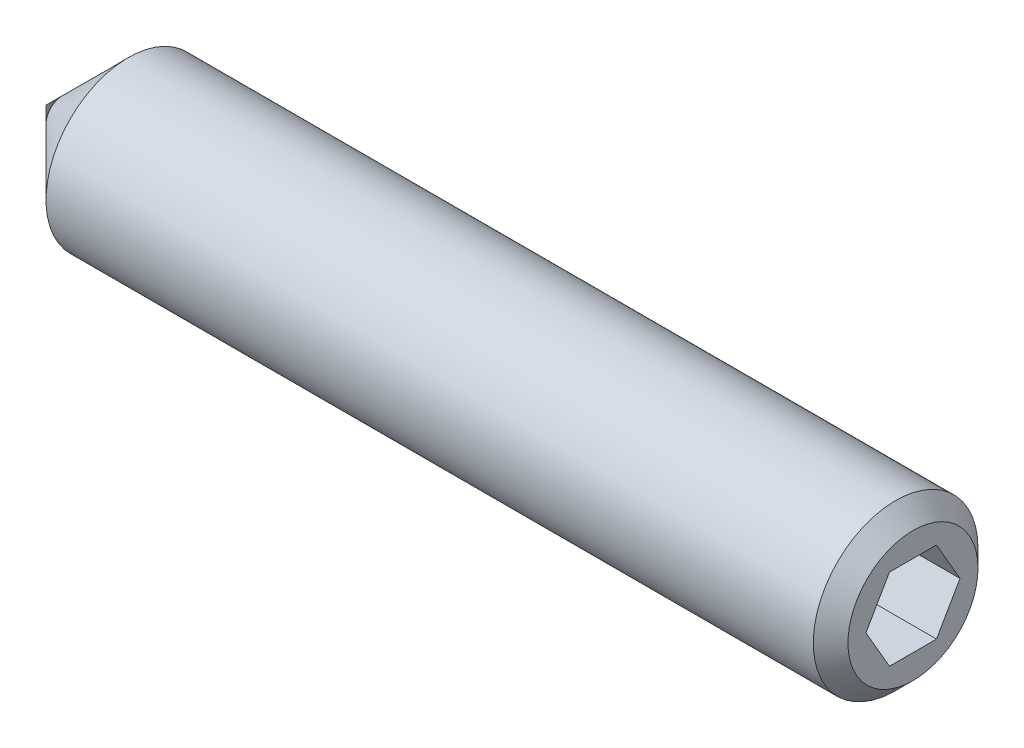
ISO-10303-21;
HEADER;
FILE_DESCRIPTION(('STEP AP214'),'2;1');
FILE_NAME('part.step','',(''),(''),'','','');
FILE_SCHEMA(('AUTOMOTIVE_DESIGN { 1 0 10303 214 1 1 1 1 }'));
ENDSEC;
DATA;
#1=APPLICATION_CONTEXT('core data for automotive mechanical design processes');
#2=APPLICATION_PROTOCOL_DEFINITION('international standard','automotive_design',2000,#1);
#3=PRODUCT_CONTEXT('',#1,'mechanical');
#4=PRODUCT('Part','Part','',(#3));
#5=PRODUCT_RELATED_PRODUCT_CATEGORY('part','',(#4));
#6=PRODUCT_DEFINITION_FORMATION('','',#4);
#7=PRODUCT_DEFINITION_CONTEXT('part definition',#1,'design');
#8=PRODUCT_DEFINITION('design','',#6,#7);
#9=PRODUCT_DEFINITION_SHAPE('','',#8);
#10=(LENGTH_UNIT() NAMED_UNIT(*) SI_UNIT(.MILLI.,.METRE.));
#11=(NAMED_UNIT(*) PLANE_ANGLE_UNIT() SI_UNIT($,.RADIAN.));
#12=(NAMED_UNIT(*) SI_UNIT($,.STERADIAN.) SOLID_ANGLE_UNIT());
#13=UNCERTAINTY_MEASURE_WITH_UNIT(LENGTH_MEASURE(1.E-05),#10,'distance_accuracy_value','');
#14=(GEOMETRIC_REPRESENTATION_CONTEXT(3) GLOBAL_UNCERTAINTY_ASSIGNED_CONTEXT((#13)) GLOBAL_UNIT_ASSIGNED_CONTEXT((#10,
#11,#12)) REPRESENTATION_CONTEXT('',''));
#15=CARTESIAN_POINT('',(0.,0.,0.));
#16=DIRECTION('',(0.,0.,1.));
#17=DIRECTION('',(1.,0.,0.));
#18=AXIS2_PLACEMENT_3D('',#15,#16,#17);
#19=CARTESIAN_POINT('',(25.4000000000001,2.41300000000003,0.));
#20=DIRECTION('',(1.,0.,0.));
#21=DIRECTION('',(0.,0.,-1.));
#22=AXIS2_PLACEMENT_3D('',#19,#20,#21);
#23=PLANE('',#22);
#24=DIRECTION('',(0.,-0.866025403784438,0.500000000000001));
#25=VECTOR('',#24,1.);
#26=CARTESIAN_POINT('',(25.3999999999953,0.,1.37848150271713));
#27=LINE('',#26,#25);
#28=CARTESIAN_POINT('',(25.3999999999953,1.19379999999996,0.6892407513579));
#29=VERTEX_POINT('',#28);
#30=CARTESIAN_POINT('',(25.4,0.,1.37848150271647));
#31=VERTEX_POINT('',#30);
#32=EDGE_CURVE('E44',#29,#31,#27,.T.);
#33=ORIENTED_EDGE('',*,*,#32,.F.);
#34=DIRECTION('',(0.,0.,1.));
#35=VECTOR('',#34,1.);
#36=CARTESIAN_POINT('',(25.3999999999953,1.19379999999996,0.6892407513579));
#37=LINE('',#36,#35);
#38=CARTESIAN_POINT('',(25.3999999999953,1.19379999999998,-0.689240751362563));
#39=VERTEX_POINT('',#38);
#40=EDGE_CURVE('E112',#39,#29,#37,.T.);
#41=ORIENTED_EDGE('',*,*,#40,.F.);
#42=DIRECTION('',(0.,0.866025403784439,0.499999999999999));
#43=VECTOR('',#42,1.);
#44=CARTESIAN_POINT('',(25.3999999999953,1.19379999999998,-0.689240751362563));
#45=LINE('',#44,#43);
#46=CARTESIAN_POINT('',(25.3999999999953,0.,-1.37848150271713));
#47=VERTEX_POINT('',#46);
#48=EDGE_CURVE('E106',#47,#39,#45,.T.);
#49=ORIENTED_EDGE('',*,*,#48,.F.);
#50=DIRECTION('',(0.,0.866025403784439,-0.5));
#51=VECTOR('',#50,1.);
#52=CARTESIAN_POINT('',(25.3999999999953,0.,-1.37848150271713));
#53=LINE('',#52,#51);
#54=CARTESIAN_POINT('',(25.3999999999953,-1.19379999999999,-0.689240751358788));
#55=VERTEX_POINT('',#54);
#56=EDGE_CURVE('E104',#55,#47,#53,.T.);
#57=ORIENTED_EDGE('',*,*,#56,.F.);
#58=DIRECTION('',(0.,0.,-1.));
#59=VECTOR('',#58,1.);
#60=CARTESIAN_POINT('',(25.3999999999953,-1.19379999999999,-0.689240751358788));
#61=LINE('',#60,#59);
#62=CARTESIAN_POINT('',(25.3999999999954,-1.19379999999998,0.689240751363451));
#63=VERTEX_POINT('',#62);
#64=EDGE_CURVE('E86',#63,#55,#61,.T.);
#65=ORIENTED_EDGE('',*,*,#64,.F.);
#66=DIRECTION('',(0.,-0.86602540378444,-0.500000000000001));
#67=VECTOR('',#66,1.);
#68=CARTESIAN_POINT('',(25.3999999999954,-1.19379999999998,0.689240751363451));
#69=LINE('',#68,#67);
#70=EDGE_CURVE('E97',#31,#63,#69,.T.);
#71=ORIENTED_EDGE('',*,*,#70,.F.);
#72=EDGE_LOOP('',(#33,#41,#49,#57,#65,#71));
#73=FACE_BOUND('',#72,.T.);
#74=CARTESIAN_POINT('',(25.4,0.,-3.99680288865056E-12));
#75=DIRECTION('',(1.,0.,0.));
#76=DIRECTION('',(0.,0.,-1.));
#77=AXIS2_PLACEMENT_3D('',#74,#75,#76);
#78=CIRCLE('',#77,1.90499999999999);
#79=CARTESIAN_POINT('',(25.4,0.,-1.90500000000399));
#80=VERTEX_POINT('',#79);
#81=EDGE_CURVE('E37',#80,#80,#78,.T.);
#82=ORIENTED_EDGE('',*,*,#81,.T.);
#83=EDGE_LOOP('',(#82));
#84=FACE_BOUND('',#83,.T.);
#85=ADVANCED_FACE('F30',(#73,#84),#23,.T.);
#86=CARTESIAN_POINT('',(0.,0.,0.));
#87=DIRECTION('',(1.,0.,0.));
#88=DIRECTION('',(0.,0.,-1.));
#89=AXIS2_PLACEMENT_3D('',#86,#87,#88);
#90=CYLINDRICAL_SURFACE('',#89,2.413);
#91=CARTESIAN_POINT('',(24.8920000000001,0.,0.));
#92=DIRECTION('',(1.,0.,0.));
#93=DIRECTION('',(0.,0.,-1.));
#94=AXIS2_PLACEMENT_3D('',#91,#92,#93);
#95=CIRCLE('',#94,2.413);
#96=CARTESIAN_POINT('',(24.8920000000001,0.,-2.413));
#97=VERTEX_POINT('',#96);
#98=EDGE_CURVE('E11',#97,#97,#95,.F.);
#99=ORIENTED_EDGE('',*,*,#98,.T.);
#100=EDGE_LOOP('',(#99));
#101=FACE_BOUND('',#100,.T.);
#102=CARTESIAN_POINT('',(2.41300000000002,0.,-8.88178419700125E-13));
#103=DIRECTION('',(1.,0.,0.));
#104=DIRECTION('',(0.,0.,-1.));
#105=AXIS2_PLACEMENT_3D('',#102,#103,#104);
#106=CIRCLE('',#105,2.413);
#107=CARTESIAN_POINT('',(2.41300000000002,0.,-2.41300000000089));
#108=VERTEX_POINT('',#107);
#109=EDGE_CURVE('E132',#108,#108,#106,.T.);
#110=ORIENTED_EDGE('',*,*,#109,.T.);
#111=EDGE_LOOP('',(#110));
#112=FACE_BOUND('',#111,.T.);
#113=ADVANCED_FACE('F155',(#101,#112),#90,.T.);
#114=CARTESIAN_POINT('',(2.41300000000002,0.,-8.88178419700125E-13));
#115=DIRECTION('',(1.,0.,0.));
#116=DIRECTION('',(0.,0.,-1.));
#117=AXIS2_PLACEMENT_3D('',#114,#115,#116);
#118=CONICAL_SURFACE('',#117,2.413,0.785398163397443);
#119=CARTESIAN_POINT('',(0.,0.,0.));
#120=VERTEX_POINT('',#119);
#121=VERTEX_LOOP('',#120);
#122=FACE_BOUND('',#121,.T.);
#123=ORIENTED_EDGE('',*,*,#109,.F.);
#124=EDGE_LOOP('',(#123));
#125=FACE_BOUND('',#124,.T.);
#126=ADVANCED_FACE('F146',(#122,#125),#118,.T.);
#127=CARTESIAN_POINT('',(25.4,0.,-3.99680288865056E-12));
#128=DIRECTION('',(-1.,0.,0.));
#129=DIRECTION('',(0.,0.,1.));
#130=AXIS2_PLACEMENT_3D('',#127,#128,#129);
#131=CONICAL_SURFACE('',#130,1.90499999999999,0.785398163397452);
#132=ORIENTED_EDGE('',*,*,#98,.F.);
#133=EDGE_LOOP('',(#132));
#134=FACE_BOUND('',#133,.T.);
#135=ORIENTED_EDGE('',*,*,#81,.F.);
#136=EDGE_LOOP('',(#135));
#137=FACE_BOUND('',#136,.T.);
#138=ADVANCED_FACE('F143',(#134,#137),#131,.T.);
#139=CARTESIAN_POINT('',(22.3519999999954,0.,1.37848150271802));
#140=DIRECTION('',(0.,0.500000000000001,0.86602540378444));
#141=DIRECTION('',(0.,-0.866025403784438,0.500000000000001));
#142=AXIS2_PLACEMENT_3D('',#139,#140,#141);
#143=PLANE('',#142);
#144=ORIENTED_EDGE('',*,*,#32,.T.);
#145=DIRECTION('',(1.,0.,0.));
#146=VECTOR('',#145,1.);
#147=CARTESIAN_POINT('',(22.3519999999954,0.,1.37848150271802));
#148=LINE('',#147,#146);
#149=CARTESIAN_POINT('',(22.3519999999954,0.,1.37848150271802));
#150=VERTEX_POINT('',#149);
#151=EDGE_CURVE('E94',#150,#31,#148,.T.);
#152=ORIENTED_EDGE('',*,*,#151,.F.);
#153=DIRECTION('',(0.,-0.866025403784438,0.500000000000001));
#154=VECTOR('',#153,1.);
#155=CARTESIAN_POINT('',(22.3519999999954,0.,1.37848150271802));
#156=LINE('',#155,#154);
#157=CARTESIAN_POINT('',(22.3519999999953,1.19380000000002,0.689240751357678));
#158=VERTEX_POINT('',#157);
#159=EDGE_CURVE('E115',#158,#150,#156,.T.);
#160=ORIENTED_EDGE('',*,*,#159,.F.);
#161=DIRECTION('',(1.,0.,0.));
#162=VECTOR('',#161,1.);
#163=CARTESIAN_POINT('',(22.3519999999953,1.19380000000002,0.689240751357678));
#164=LINE('',#163,#162);
#165=EDGE_CURVE('E130',#158,#29,#164,.T.);
#166=ORIENTED_EDGE('',*,*,#165,.T.);
#167=EDGE_LOOP('',(#144,#152,#160,#166));
#168=FACE_BOUND('',#167,.T.);
#169=ADVANCED_FACE('F145',(#168),#143,.F.);
#170=CARTESIAN_POINT('',(22.3519999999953,1.19380000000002,0.689240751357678));
#171=DIRECTION('',(0.,0.999999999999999,0.));
#172=DIRECTION('',(0.,0.,1.));
#173=AXIS2_PLACEMENT_3D('',#170,#171,#172);
#174=PLANE('',#173);
#175=ORIENTED_EDGE('',*,*,#40,.T.);
#176=ORIENTED_EDGE('',*,*,#165,.F.);
#177=DIRECTION('',(0.,0.,1.));
#178=VECTOR('',#177,1.);
#179=CARTESIAN_POINT('',(22.3519999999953,1.19380000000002,0.689240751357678));
#180=LINE('',#179,#178);
#181=CARTESIAN_POINT('',(22.3519999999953,1.1938,-0.689240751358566));
#182=VERTEX_POINT('',#181);
#183=EDGE_CURVE('E127',#182,#158,#180,.T.);
#184=ORIENTED_EDGE('',*,*,#183,.F.);
#185=DIRECTION('',(1.,0.,0.));
#186=VECTOR('',#185,1.);
#187=CARTESIAN_POINT('',(22.3519999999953,1.1938,-0.689240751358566));
#188=LINE('',#187,#186);
#189=EDGE_CURVE('E133',#182,#39,#188,.T.);
#190=ORIENTED_EDGE('',*,*,#189,.T.);
#191=EDGE_LOOP('',(#175,#176,#184,#190));
#192=FACE_BOUND('',#191,.T.);
#193=ADVANCED_FACE('F153',(#192),#174,.F.);
#194=CARTESIAN_POINT('',(22.3519999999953,1.1938,-0.689240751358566));
#195=DIRECTION('',(0.,0.499999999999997,-0.866025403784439));
#196=DIRECTION('',(0.,0.866025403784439,0.499999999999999));
#197=AXIS2_PLACEMENT_3D('',#194,#195,#196);
#198=PLANE('',#197);
#199=ORIENTED_EDGE('',*,*,#48,.T.);
#200=ORIENTED_EDGE('',*,*,#189,.F.);
#201=DIRECTION('',(0.,0.866025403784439,0.499999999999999));
#202=VECTOR('',#201,1.);
#203=CARTESIAN_POINT('',(22.3519999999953,1.1938,-0.689240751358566));
#204=LINE('',#203,#202);
#205=CARTESIAN_POINT('',(22.3519999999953,0.,-1.37848150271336));
#206=VERTEX_POINT('',#205);
#207=EDGE_CURVE('E124',#206,#182,#204,.T.);
#208=ORIENTED_EDGE('',*,*,#207,.F.);
#209=DIRECTION('',(1.,0.,0.));
#210=VECTOR('',#209,1.);
#211=CARTESIAN_POINT('',(22.3519999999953,0.,-1.37848150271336));
#212=LINE('',#211,#210);
#213=EDGE_CURVE('E135',#206,#47,#212,.T.);
#214=ORIENTED_EDGE('',*,*,#213,.T.);
#215=EDGE_LOOP('',(#199,#200,#208,#214));
#216=FACE_BOUND('',#215,.T.);
#217=ADVANCED_FACE('F191',(#216),#198,.F.);
#218=CARTESIAN_POINT('',(22.3519999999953,0.,-1.37848150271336));
#219=DIRECTION('',(0.,-0.499999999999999,-0.866025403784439));
#220=DIRECTION('',(0.,0.866025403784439,-0.5));
#221=AXIS2_PLACEMENT_3D('',#218,#219,#220);
#222=PLANE('',#221);
#223=ORIENTED_EDGE('',*,*,#56,.T.);
#224=ORIENTED_EDGE('',*,*,#213,.F.);
#225=DIRECTION('',(0.,0.866025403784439,-0.5));
#226=VECTOR('',#225,1.);
#227=CARTESIAN_POINT('',(22.3519999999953,0.,-1.37848150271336));
#228=LINE('',#227,#226);
#229=CARTESIAN_POINT('',(22.3519999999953,-1.19380000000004,-0.689240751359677));
#230=VERTEX_POINT('',#229);
#231=EDGE_CURVE('E121',#230,#206,#228,.T.);
#232=ORIENTED_EDGE('',*,*,#231,.F.);
#233=DIRECTION('',(1.,0.,0.));
#234=VECTOR('',#233,1.);
#235=CARTESIAN_POINT('',(22.3519999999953,-1.19380000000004,-0.689240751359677));
#236=LINE('',#235,#234);
#237=EDGE_CURVE('E93',#230,#55,#236,.T.);
#238=ORIENTED_EDGE('',*,*,#237,.T.);
#239=EDGE_LOOP('',(#223,#224,#232,#238));
#240=FACE_BOUND('',#239,.T.);
#241=ADVANCED_FACE('F201',(#240),#222,.F.);
#242=CARTESIAN_POINT('',(22.3519999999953,-1.19380000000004,-0.689240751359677));
#243=DIRECTION('',(0.,-0.999999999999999,0.));
#244=DIRECTION('',(0.,0.,-1.));
#245=AXIS2_PLACEMENT_3D('',#242,#243,#244);
#246=PLANE('',#245);
#247=ORIENTED_EDGE('',*,*,#64,.T.);
#248=ORIENTED_EDGE('',*,*,#237,.F.);
#249=DIRECTION('',(0.,0.,-1.));
#250=VECTOR('',#249,1.);
#251=CARTESIAN_POINT('',(22.3519999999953,-1.19380000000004,-0.689240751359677));
#252=LINE('',#251,#250);
#253=CARTESIAN_POINT('',(22.3519999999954,-1.19380000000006,0.689240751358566));
#254=VERTEX_POINT('',#253);
#255=EDGE_CURVE('E89',#254,#230,#252,.T.);
#256=ORIENTED_EDGE('',*,*,#255,.F.);
#257=DIRECTION('',(1.,0.,0.));
#258=VECTOR('',#257,1.);
#259=CARTESIAN_POINT('',(22.3519999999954,-1.19380000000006,0.689240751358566));
#260=LINE('',#259,#258);
#261=EDGE_CURVE('E82',#254,#63,#260,.T.);
#262=ORIENTED_EDGE('',*,*,#261,.T.);
#263=EDGE_LOOP('',(#247,#248,#256,#262));
#264=FACE_BOUND('',#263,.T.);
#265=ADVANCED_FACE('F84',(#264),#246,.F.);
#266=CARTESIAN_POINT('',(22.3519999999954,-1.19380000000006,0.689240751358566));
#267=DIRECTION('',(0.,-0.5,0.866025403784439));
#268=DIRECTION('',(0.,-0.86602540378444,-0.500000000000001));
#269=AXIS2_PLACEMENT_3D('',#266,#267,#268);
#270=PLANE('',#269);
#271=ORIENTED_EDGE('',*,*,#70,.T.);
#272=ORIENTED_EDGE('',*,*,#261,.F.);
#273=DIRECTION('',(0.,-0.86602540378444,-0.500000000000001));
#274=VECTOR('',#273,1.);
#275=CARTESIAN_POINT('',(22.3519999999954,-1.19380000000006,0.689240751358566));
#276=LINE('',#275,#274);
#277=EDGE_CURVE('E118',#150,#254,#276,.T.);
#278=ORIENTED_EDGE('',*,*,#277,.F.);
#279=ORIENTED_EDGE('',*,*,#151,.T.);
#280=EDGE_LOOP('',(#271,#272,#278,#279));
#281=FACE_BOUND('',#280,.T.);
#282=ADVANCED_FACE('F98',(#281),#270,.F.);
#283=CARTESIAN_POINT('',(22.3519999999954,0.,1.37848150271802));
#284=DIRECTION('',(1.,0.,0.));
#285=DIRECTION('',(0.,0.,-1.));
#286=AXIS2_PLACEMENT_3D('',#283,#284,#285);
#287=PLANE('',#286);
#288=ORIENTED_EDGE('',*,*,#159,.T.);
#289=ORIENTED_EDGE('',*,*,#277,.T.);
#290=ORIENTED_EDGE('',*,*,#255,.T.);
#291=ORIENTED_EDGE('',*,*,#231,.T.);
#292=ORIENTED_EDGE('',*,*,#207,.T.);
#293=ORIENTED_EDGE('',*,*,#183,.T.);
#294=EDGE_LOOP('',(#288,#289,#290,#291,#292,#293));
#295=FACE_BOUND('',#294,.T.);
#296=ADVANCED_FACE('F228',(#295),#287,.T.);
#297=CLOSED_SHELL('',(#85,#113,#126,#138,#169,#193,#217,#241,#265,#282,#296));
#298=MANIFOLD_SOLID_BREP('B2',#297);
#299=ADVANCED_BREP_SHAPE_REPRESENTATION('',(#18,#298),#14);
#300=SHAPE_DEFINITION_REPRESENTATION(#9,#299);
ENDSEC;
END-ISO-10303-21;
